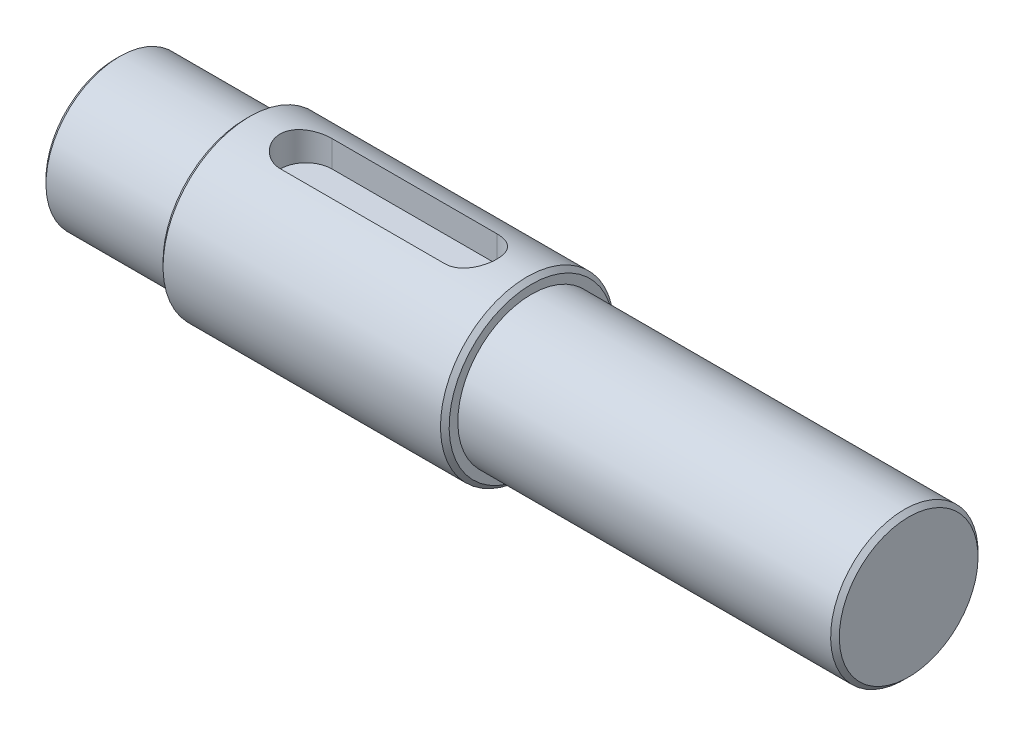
from build123d import *

# Parameters (mm, degrees)
CUT_EXTRUDE1_REACH      = 95.512
CUT_EXTRUDE1_END_RADIUS = 10


with BuildPart() as part:
    # Sketch1 → Revolve1 (revolve)
    with BuildSketch(Plane.XY):
        Polygon((0, 0), (0, 8), (0.5, 8.5), (15, 8.5), (15, 9.5), (15.5, 10), (47.5, 10), (48, 9.5), (48, 8.5), (91, 8.5), (91.5, 8), (91.5, 0), align=None)
    revolve(axis=Axis((91.5, 0, 0), (-1, 0, 0)))

    # Cut-Extrude1: up to this cylinder (the profile starts inside it)
    cut_extrude1_end = Plane(origin=(31.5, 0, 0), z_dir=(1, 0, 0)) * Cylinder(CUT_EXTRUDE1_END_RADIUS, 212.024, mode=Mode.PRIVATE)
    # Sketch2 → Cut-Extrude1 (cut, up to the surface)
    with BuildSketch(Plane(origin=(0, 6.5, 0), x_dir=(1, 0, 0), z_dir=(0, 1, 0)), mode=Mode.PRIVATE) as cut_extrude1_sk1:
        with BuildLine():
            Line((22, 3), (41, 3))
            ThreePointArc((41, 3), (44, 0), (41, -3))
            Line((41, -3), (22, -3))
            ThreePointArc((22, -3), (19, 0), (22, 3))
        make_face()
    cut_extrude1_tool1 = extrude(cut_extrude1_sk1.sketch, amount=CUT_EXTRUDE1_REACH, mode=Mode.PRIVATE) & cut_extrude1_end
    add(cut_extrude1_tool1.solids().sort_by_distance((31.5, 6.5, 0))[0], mode=Mode.SUBTRACT)


solid = part.part
